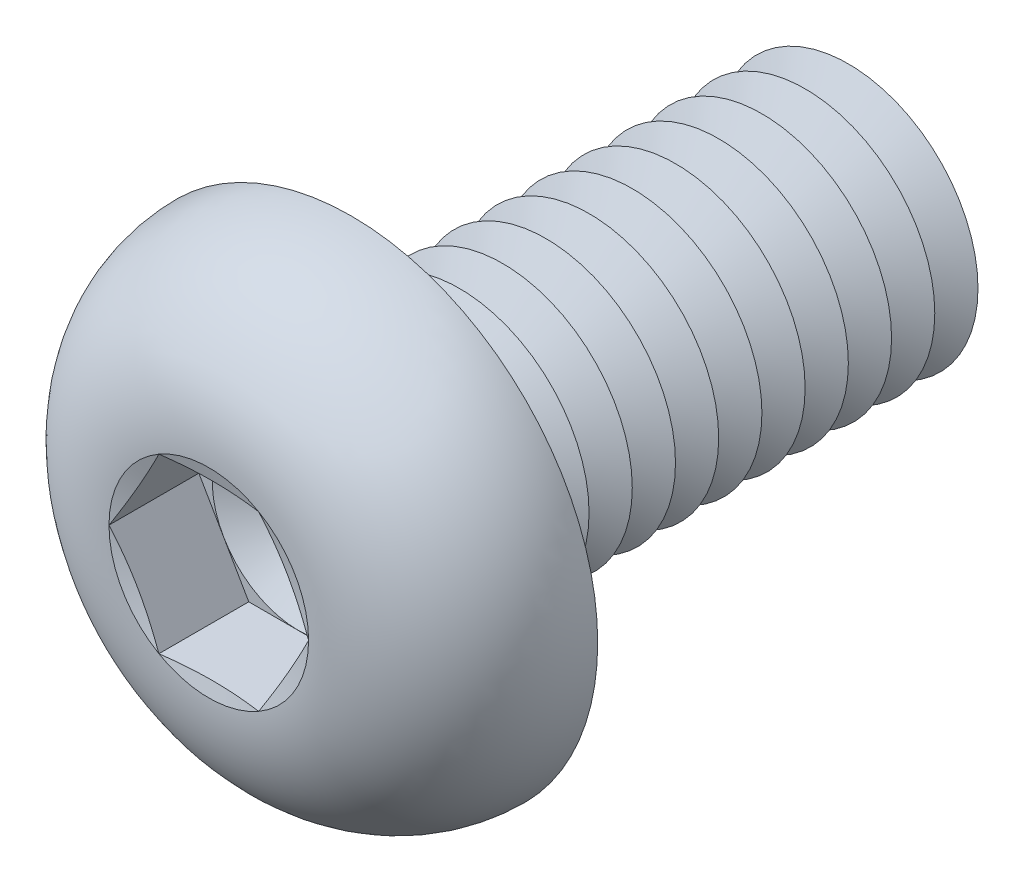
ISO-10303-21;
HEADER;
FILE_DESCRIPTION(('STEP AP214'),'2;1');
FILE_NAME('part.step','',(''),(''),'','','');
FILE_SCHEMA(('AUTOMOTIVE_DESIGN { 1 0 10303 214 1 1 1 1 }'));
ENDSEC;
DATA;
#1=APPLICATION_CONTEXT('core data for automotive mechanical design processes');
#2=APPLICATION_PROTOCOL_DEFINITION('international standard','automotive_design',2000,#1);
#3=PRODUCT_CONTEXT('',#1,'mechanical');
#4=PRODUCT('Part','Part','',(#3));
#5=PRODUCT_RELATED_PRODUCT_CATEGORY('part','',(#4));
#6=PRODUCT_DEFINITION_FORMATION('','',#4);
#7=PRODUCT_DEFINITION_CONTEXT('part definition',#1,'design');
#8=PRODUCT_DEFINITION('design','',#6,#7);
#9=PRODUCT_DEFINITION_SHAPE('','',#8);
#10=(LENGTH_UNIT() NAMED_UNIT(*) SI_UNIT(.MILLI.,.METRE.));
#11=(NAMED_UNIT(*) PLANE_ANGLE_UNIT() SI_UNIT($,.RADIAN.));
#12=(NAMED_UNIT(*) SI_UNIT($,.STERADIAN.) SOLID_ANGLE_UNIT());
#13=UNCERTAINTY_MEASURE_WITH_UNIT(LENGTH_MEASURE(1.E-05),#10,'distance_accuracy_value','');
#14=(GEOMETRIC_REPRESENTATION_CONTEXT(3) GLOBAL_UNCERTAINTY_ASSIGNED_CONTEXT((#13)) GLOBAL_UNIT_ASSIGNED_CONTEXT((#10,
#11,#12)) REPRESENTATION_CONTEXT('',''));
#15=CARTESIAN_POINT('',(0.,0.,0.));
#16=DIRECTION('',(0.,0.,1.));
#17=DIRECTION('',(1.,0.,0.));
#18=AXIS2_PLACEMENT_3D('',#15,#16,#17);
#19=CARTESIAN_POINT('',(0.,0.,0.609999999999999));
#20=DIRECTION('',(0.,0.,1.));
#21=DIRECTION('',(1.,0.,0.));
#22=AXIS2_PLACEMENT_3D('',#19,#20,#21);
#23=PLANE('',#22);
#24=CARTESIAN_POINT('',(0.,0.,0.609999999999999));
#25=DIRECTION('',(0.,0.,1.));
#26=DIRECTION('',(1.,0.,0.));
#27=AXIS2_PLACEMENT_3D('',#24,#25,#26);
#28=CIRCLE('',#27,0.999999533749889);
#29=CARTESIAN_POINT('',(0.866024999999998,0.499999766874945,0.609999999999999));
#30=VERTEX_POINT('',#29);
#31=CARTESIAN_POINT('',(0.,0.999999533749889,0.609999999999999));
#32=VERTEX_POINT('',#31);
#33=EDGE_CURVE('E118',#30,#32,#28,.T.);
#34=ORIENTED_EDGE('',*,*,#33,.F.);
#35=DIRECTION('',(-0.500000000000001,0.866025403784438,0.));
#36=VECTOR('',#35,1.);
#37=CARTESIAN_POINT('',(1.1547,0.,0.609999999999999));
#38=LINE('',#37,#36);
#39=CARTESIAN_POINT('',(0.577349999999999,0.999999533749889,0.609999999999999));
#40=VERTEX_POINT('',#39);
#41=EDGE_CURVE('E125',#30,#40,#38,.T.);
#42=ORIENTED_EDGE('',*,*,#41,.T.);
#43=DIRECTION('',(-1.,0.,0.));
#44=VECTOR('',#43,1.);
#45=CARTESIAN_POINT('',(0.577349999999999,0.999999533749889,0.609999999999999));
#46=LINE('',#45,#44);
#47=EDGE_CURVE('E136',#40,#32,#46,.T.);
#48=ORIENTED_EDGE('',*,*,#47,.T.);
#49=EDGE_LOOP('',(#34,#42,#48));
#50=FACE_BOUND('',#49,.T.);
#51=ADVANCED_FACE('F39',(#50),#23,.T.);
#52=CARTESIAN_POINT('',(0.,0.,0.609999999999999));
#53=DIRECTION('',(0.,0.,1.));
#54=DIRECTION('',(1.,0.,0.));
#55=AXIS2_PLACEMENT_3D('',#52,#53,#54);
#56=CIRCLE('',#55,0.999999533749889);
#57=CARTESIAN_POINT('',(-0.866024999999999,0.499999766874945,0.609999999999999));
#58=VERTEX_POINT('',#57);
#59=EDGE_CURVE('E11',#32,#58,#56,.T.);
#60=ORIENTED_EDGE('',*,*,#59,.F.);
#61=CARTESIAN_POINT('',(-0.577350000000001,0.999999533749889,0.609999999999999));
#62=VERTEX_POINT('',#61);
#63=EDGE_CURVE('E131',#32,#62,#46,.T.);
#64=ORIENTED_EDGE('',*,*,#63,.T.);
#65=DIRECTION('',(-0.5,-0.866025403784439,0.));
#66=VECTOR('',#65,1.);
#67=CARTESIAN_POINT('',(-0.577350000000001,0.999999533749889,0.609999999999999));
#68=LINE('',#67,#66);
#69=EDGE_CURVE('E134',#62,#58,#68,.T.);
#70=ORIENTED_EDGE('',*,*,#69,.T.);
#71=EDGE_LOOP('',(#60,#64,#70));
#72=FACE_BOUND('',#71,.T.);
#73=ADVANCED_FACE('F130',(#72),#23,.T.);
#74=CARTESIAN_POINT('',(-0.866024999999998,-0.499999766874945,0.609999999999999));
#75=VERTEX_POINT('',#74);
#76=EDGE_CURVE('E49',#58,#75,#56,.T.);
#77=ORIENTED_EDGE('',*,*,#76,.F.);
#78=CARTESIAN_POINT('',(-1.1547,0.,0.609999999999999));
#79=VERTEX_POINT('',#78);
#80=EDGE_CURVE('E143',#58,#79,#68,.T.);
#81=ORIENTED_EDGE('',*,*,#80,.T.);
#82=DIRECTION('',(0.5,-0.866025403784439,0.));
#83=VECTOR('',#82,1.);
#84=CARTESIAN_POINT('',(-1.1547,0.,0.609999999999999));
#85=LINE('',#84,#83);
#86=EDGE_CURVE('E151',#79,#75,#85,.T.);
#87=ORIENTED_EDGE('',*,*,#86,.T.);
#88=EDGE_LOOP('',(#77,#81,#87));
#89=FACE_BOUND('',#88,.T.);
#90=ADVANCED_FACE('F363',(#89),#23,.T.);
#91=CARTESIAN_POINT('',(0.,-0.999999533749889,0.609999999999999));
#92=VERTEX_POINT('',#91);
#93=EDGE_CURVE('E347',#75,#92,#56,.T.);
#94=ORIENTED_EDGE('',*,*,#93,.F.);
#95=CARTESIAN_POINT('',(-0.577349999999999,-0.99999953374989,0.609999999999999));
#96=VERTEX_POINT('',#95);
#97=EDGE_CURVE('E150',#75,#96,#85,.T.);
#98=ORIENTED_EDGE('',*,*,#97,.T.);
#99=DIRECTION('',(1.,0.,0.));
#100=VECTOR('',#99,1.);
#101=CARTESIAN_POINT('',(-0.577349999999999,-0.99999953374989,0.609999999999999));
#102=LINE('',#101,#100);
#103=EDGE_CURVE('E156',#96,#92,#102,.T.);
#104=ORIENTED_EDGE('',*,*,#103,.T.);
#105=EDGE_LOOP('',(#94,#98,#104));
#106=FACE_BOUND('',#105,.T.);
#107=ADVANCED_FACE('F356',(#106),#23,.T.);
#108=CARTESIAN_POINT('',(0.866024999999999,-0.499999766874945,0.609999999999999));
#109=VERTEX_POINT('',#108);
#110=EDGE_CURVE('E56',#92,#109,#56,.T.);
#111=ORIENTED_EDGE('',*,*,#110,.F.);
#112=CARTESIAN_POINT('',(0.577349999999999,-0.99999953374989,0.609999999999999));
#113=VERTEX_POINT('',#112);
#114=EDGE_CURVE('E155',#92,#113,#102,.T.);
#115=ORIENTED_EDGE('',*,*,#114,.T.);
#116=DIRECTION('',(0.5,0.866025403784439,0.));
#117=VECTOR('',#116,1.);
#118=CARTESIAN_POINT('',(0.577349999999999,-0.99999953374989,0.609999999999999));
#119=LINE('',#118,#117);
#120=EDGE_CURVE('E161',#113,#109,#119,.T.);
#121=ORIENTED_EDGE('',*,*,#120,.T.);
#122=EDGE_LOOP('',(#111,#115,#121));
#123=FACE_BOUND('',#122,.T.);
#124=ADVANCED_FACE('F429',(#123),#23,.T.);
#125=CARTESIAN_POINT('',(0.,0.,1.65));
#126=DIRECTION('',(0.,0.,1.));
#127=DIRECTION('',(1.,0.,0.));
#128=AXIS2_PLACEMENT_3D('',#125,#126,#127);
#129=CONICAL_SURFACE('',#128,1.1547,1.30899693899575);
#130=CARTESIAN_POINT('',(1.15481547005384,-0.000199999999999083,1.65003094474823));
#131=CARTESIAN_POINT('',(1.13083002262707,0.0413440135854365,1.64359970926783));
#132=CARTESIAN_POINT('',(1.10680107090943,0.0829633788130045,1.63776108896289));
#133=CARTESIAN_POINT('',(1.05865826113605,0.166349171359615,1.62750303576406));
#134=CARTESIAN_POINT('',(1.03454437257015,0.208115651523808,1.62308418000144));
#135=CARTESIAN_POINT('',(0.986377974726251,0.291542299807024,1.61592375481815));
#136=CARTESIAN_POINT('',(0.962325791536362,0.333201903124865,1.61317364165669));
#137=CARTESIAN_POINT('',(0.914190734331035,0.416574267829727,1.60948600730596));
#138=CARTESIAN_POINT('',(0.890107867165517,0.458287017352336,1.60854813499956));
#139=CARTESIAN_POINT('',(0.841942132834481,0.541712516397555,1.60854813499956));
#140=CARTESIAN_POINT('',(0.817859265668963,0.583425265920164,1.60948600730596));
#141=CARTESIAN_POINT('',(0.769724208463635,0.666797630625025,1.61317364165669));
#142=CARTESIAN_POINT('',(0.745672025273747,0.708457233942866,1.61592375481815));
#143=CARTESIAN_POINT('',(0.697505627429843,0.791883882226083,1.62308418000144));
#144=CARTESIAN_POINT('',(0.673391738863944,0.833650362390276,1.62750303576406));
#145=CARTESIAN_POINT('',(0.625248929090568,0.917036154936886,1.63776108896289));
#146=CARTESIAN_POINT('',(0.60121997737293,0.958655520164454,1.64359970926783));
#147=CARTESIAN_POINT('',(0.577234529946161,1.00019953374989,1.65003094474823));
#148=B_SPLINE_CURVE_WITH_KNOTS('',3,(#130,#131,#132,#133,#134,#135,#136,#137,#138,#139,#140,
#141,#142,#143,#144,#145,#146,#147),.UNSPECIFIED.,.F.,.F.,(4,2,2,2,2,2,2,2,4),(0.,
0.145207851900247,0.290474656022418,0.434991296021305,0.579479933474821,0.723968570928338,
0.868485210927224,1.0137520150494,1.15895986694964),.UNSPECIFIED.);
#149=CARTESIAN_POINT('',(1.1547,0.,1.65));
#150=VERTEX_POINT('',#149);
#151=CARTESIAN_POINT('',(0.57735,0.99999953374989,1.65));
#152=VERTEX_POINT('',#151);
#153=EDGE_CURVE('E220',#150,#152,#148,.T.);
#154=ORIENTED_EDGE('',*,*,#153,.F.);
#155=CARTESIAN_POINT('',(0.,0.,1.65));
#156=DIRECTION('',(0.,0.,-1.));
#157=DIRECTION('',(-1.,0.,0.));
#158=AXIS2_PLACEMENT_3D('',#155,#156,#157);
#159=CIRCLE('',#158,1.1547);
#160=EDGE_CURVE('E394',#152,#150,#159,.T.);
#161=ORIENTED_EDGE('',*,*,#160,.F.);
#162=EDGE_LOOP('',(#154,#161));
#163=FACE_BOUND('',#162,.T.);
#164=ADVANCED_FACE('F433',(#163),#129,.F.);
#165=CARTESIAN_POINT('',(0.577234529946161,-1.00019953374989,1.65003094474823));
#166=CARTESIAN_POINT('',(0.60121997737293,-0.958655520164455,1.64359970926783));
#167=CARTESIAN_POINT('',(0.625248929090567,-0.917036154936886,1.63776108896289));
#168=CARTESIAN_POINT('',(0.673391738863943,-0.833650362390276,1.62750303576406));
#169=CARTESIAN_POINT('',(0.697505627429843,-0.791883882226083,1.62308418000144));
#170=CARTESIAN_POINT('',(0.745672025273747,-0.708457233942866,1.61592375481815));
#171=CARTESIAN_POINT('',(0.769724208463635,-0.666797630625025,1.61317364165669));
#172=CARTESIAN_POINT('',(0.817859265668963,-0.583425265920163,1.60948600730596));
#173=CARTESIAN_POINT('',(0.841942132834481,-0.541712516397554,1.60854813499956));
#174=CARTESIAN_POINT('',(0.890107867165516,-0.458287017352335,1.60854813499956));
#175=CARTESIAN_POINT('',(0.914190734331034,-0.416574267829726,1.60948600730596));
#176=CARTESIAN_POINT('',(0.962325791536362,-0.333201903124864,1.61317364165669));
#177=CARTESIAN_POINT('',(0.986377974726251,-0.291542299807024,1.61592375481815));
#178=CARTESIAN_POINT('',(1.03454437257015,-0.208115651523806,1.62308418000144));
#179=CARTESIAN_POINT('',(1.05865826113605,-0.166349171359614,1.62750303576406));
#180=CARTESIAN_POINT('',(1.10680107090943,-0.0829633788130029,1.63776108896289));
#181=CARTESIAN_POINT('',(1.13083002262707,-0.0413440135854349,1.64359970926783));
#182=CARTESIAN_POINT('',(1.15481547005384,0.00020000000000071,1.65003094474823));
#183=B_SPLINE_CURVE_WITH_KNOTS('',3,(#165,#166,#167,#168,#169,#170,#171,#172,#173,#174,#175,
#176,#177,#178,#179,#180,#181,#182),.UNSPECIFIED.,.F.,.F.,(4,2,2,2,2,2,2,2,4),(0.,
0.145207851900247,0.290474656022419,0.434991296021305,0.579479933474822,0.723968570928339,
0.868485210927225,1.0137520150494,1.15895986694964),.UNSPECIFIED.);
#184=CARTESIAN_POINT('',(0.577349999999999,-0.99999953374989,1.65));
#185=VERTEX_POINT('',#184);
#186=EDGE_CURVE('E229',#185,#150,#183,.T.);
#187=ORIENTED_EDGE('',*,*,#186,.F.);
#188=EDGE_CURVE('E396',#150,#185,#159,.T.);
#189=ORIENTED_EDGE('',*,*,#188,.F.);
#190=EDGE_LOOP('',(#187,#189));
#191=FACE_BOUND('',#190,.T.);
#192=ADVANCED_FACE('F439',(#191),#129,.F.);
#193=CARTESIAN_POINT('',(-1.7425668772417,-0.99999953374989,1.87893949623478));
#194=CARTESIAN_POINT('',(-1.65819693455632,-0.99999953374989,1.85935934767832));
#195=CARTESIAN_POINT('',(-1.57375647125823,-0.99999953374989,1.84006351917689));
#196=CARTESIAN_POINT('',(-1.40464514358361,-0.99999953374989,1.80242908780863));
#197=CARTESIAN_POINT('',(-1.31997423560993,-0.99999953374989,1.78409068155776));
#198=CARTESIAN_POINT('',(-1.14955192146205,-0.99999953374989,1.74860242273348));
#199=CARTESIAN_POINT('',(-1.06379782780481,-0.99999953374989,1.73146532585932));
#200=CARTESIAN_POINT('',(-0.891887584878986,-0.99999953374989,1.69925819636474));
#201=CARTESIAN_POINT('',(-0.805731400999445,-0.99999953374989,1.68418834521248));
#202=CARTESIAN_POINT('',(-0.635256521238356,-0.99999953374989,1.65751615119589));
#203=CARTESIAN_POINT('',(-0.550951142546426,-0.99999953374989,1.64583105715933));
#204=CARTESIAN_POINT('',(-0.381865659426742,-0.99999953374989,1.62668811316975));
#205=CARTESIAN_POINT('',(-0.297085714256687,-0.99999953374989,1.61922892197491));
#206=CARTESIAN_POINT('',(-0.127577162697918,-0.99999953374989,1.60981453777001));
#207=CARTESIAN_POINT('',(-0.0428499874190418,-0.99999953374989,1.60783514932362));
#208=CARTESIAN_POINT('',(0.126542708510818,-0.99999953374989,1.60973012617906));
#209=CARTESIAN_POINT('',(0.211208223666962,-0.99999953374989,1.61360496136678));
#210=CARTESIAN_POINT('',(0.356115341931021,-0.99999953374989,1.62460226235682));
#211=CARTESIAN_POINT('',(0.416458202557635,-0.99999953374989,1.63048841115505));
#212=CARTESIAN_POINT('',(0.536893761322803,-0.99999953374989,1.64437752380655));
#213=CARTESIAN_POINT('',(0.596986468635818,-0.99999953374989,1.65238040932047));
#214=CARTESIAN_POINT('',(0.777275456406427,-0.99999953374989,1.67888855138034));
#215=CARTESIAN_POINT('',(0.897104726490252,-0.99999953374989,1.69985858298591));
#216=CARTESIAN_POINT('',(1.07751611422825,-0.99999953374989,1.73433574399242));
#217=CARTESIAN_POINT('',(1.1383777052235,-0.99999953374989,1.74646914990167));
#218=CARTESIAN_POINT('',(1.25994955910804,-0.99999953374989,1.7714845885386));
#219=CARTESIAN_POINT('',(1.32065982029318,-0.99999953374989,1.7843666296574));
#220=CARTESIAN_POINT('',(1.44162663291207,-0.99999953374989,1.81062164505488));
#221=CARTESIAN_POINT('',(1.50188385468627,-0.99999953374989,1.82399156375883));
#222=CARTESIAN_POINT('',(1.62229550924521,-0.99999953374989,1.85116781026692));
#223=CARTESIAN_POINT('',(1.68244994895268,-0.99999953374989,1.86497410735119));
#224=CARTESIAN_POINT('',(1.7425668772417,-0.99999953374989,1.87893949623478));
#225=B_SPLINE_CURVE_WITH_KNOTS('',3,(#193,#194,#195,#196,#197,#198,#199,#200,#201,#202,#203,
#204,#205,#206,#207,#208,#209,#210,#211,#212,#213,#214,#215,#216,#217,#218,#219,#220,#221,#222,
#223,#224),.UNSPECIFIED.,.F.,.F.,(4,2,2,2,2,2,2,2,2,2,2,2,2,2,2,4),(0.,0.259842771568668,
0.519738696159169,0.782071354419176,1.04442702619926,1.29968778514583,1.55486748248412,
1.80891865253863,2.06299021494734,2.24483732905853,2.42667771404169,2.79149503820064,
2.97767344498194,3.16385393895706,3.34902052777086,3.53417411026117),.UNSPECIFIED.);
#226=CARTESIAN_POINT('',(-0.577349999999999,-0.99999953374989,1.65));
#227=VERTEX_POINT('',#226);
#228=EDGE_CURVE('E375',#227,#185,#225,.T.);
#229=ORIENTED_EDGE('',*,*,#228,.F.);
#230=EDGE_CURVE('E383',#185,#227,#159,.T.);
#231=ORIENTED_EDGE('',*,*,#230,.F.);
#232=EDGE_LOOP('',(#229,#231));
#233=FACE_BOUND('',#232,.T.);
#234=ADVANCED_FACE('F455',(#233),#129,.F.);
#235=CARTESIAN_POINT('',(-1.15481547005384,0.000200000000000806,1.65003094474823));
#236=CARTESIAN_POINT('',(-1.13083002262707,-0.0413440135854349,1.64359970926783));
#237=CARTESIAN_POINT('',(-1.10680107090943,-0.082963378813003,1.63776108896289));
#238=CARTESIAN_POINT('',(-1.05865826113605,-0.166349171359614,1.62750303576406));
#239=CARTESIAN_POINT('',(-1.03454437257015,-0.208115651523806,1.62308418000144));
#240=CARTESIAN_POINT('',(-0.986377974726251,-0.291542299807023,1.61592375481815));
#241=CARTESIAN_POINT('',(-0.962325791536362,-0.333201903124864,1.61317364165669));
#242=CARTESIAN_POINT('',(-0.914190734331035,-0.416574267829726,1.60948600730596));
#243=CARTESIAN_POINT('',(-0.890107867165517,-0.458287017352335,1.60854813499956));
#244=CARTESIAN_POINT('',(-0.841942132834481,-0.541712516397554,1.60854813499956));
#245=CARTESIAN_POINT('',(-0.817859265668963,-0.583425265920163,1.60948600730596));
#246=CARTESIAN_POINT('',(-0.769724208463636,-0.666797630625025,1.61317364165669));
#247=CARTESIAN_POINT('',(-0.745672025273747,-0.708457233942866,1.61592375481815));
#248=CARTESIAN_POINT('',(-0.697505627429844,-0.791883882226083,1.62308418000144));
#249=CARTESIAN_POINT('',(-0.673391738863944,-0.833650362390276,1.62750303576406));
#250=CARTESIAN_POINT('',(-0.625248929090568,-0.917036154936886,1.63776108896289));
#251=CARTESIAN_POINT('',(-0.60121997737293,-0.958655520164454,1.64359970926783));
#252=CARTESIAN_POINT('',(-0.577234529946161,-1.00019953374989,1.65003094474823));
#253=B_SPLINE_CURVE_WITH_KNOTS('',3,(#235,#236,#237,#238,#239,#240,#241,#242,#243,#244,#245,
#246,#247,#248,#249,#250,#251,#252),.UNSPECIFIED.,.F.,.F.,(4,2,2,2,2,2,2,2,4),(0.,
0.145207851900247,0.290474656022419,0.434991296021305,0.579479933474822,0.723968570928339,
0.868485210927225,1.0137520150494,1.15895986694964),.UNSPECIFIED.);
#254=CARTESIAN_POINT('',(-1.1547,0.,1.65));
#255=VERTEX_POINT('',#254);
#256=EDGE_CURVE('E368',#255,#227,#253,.T.);
#257=ORIENTED_EDGE('',*,*,#256,.F.);
#258=EDGE_CURVE('E331',#227,#255,#159,.T.);
#259=ORIENTED_EDGE('',*,*,#258,.F.);
#260=EDGE_LOOP('',(#257,#259));
#261=FACE_BOUND('',#260,.T.);
#262=ADVANCED_FACE('F372',(#261),#129,.F.);
#263=CARTESIAN_POINT('',(-0.577234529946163,1.00019953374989,1.65003094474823));
#264=CARTESIAN_POINT('',(-0.601219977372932,0.958655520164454,1.64359970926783));
#265=CARTESIAN_POINT('',(-0.625248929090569,0.917036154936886,1.63776108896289));
#266=CARTESIAN_POINT('',(-0.673391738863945,0.833650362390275,1.62750303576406));
#267=CARTESIAN_POINT('',(-0.697505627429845,0.791883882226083,1.62308418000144));
#268=CARTESIAN_POINT('',(-0.745672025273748,0.708457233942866,1.61592375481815));
#269=CARTESIAN_POINT('',(-0.769724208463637,0.666797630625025,1.61317364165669));
#270=CARTESIAN_POINT('',(-0.817859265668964,0.583425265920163,1.60948600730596));
#271=CARTESIAN_POINT('',(-0.841942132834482,0.541712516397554,1.60854813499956));
#272=CARTESIAN_POINT('',(-0.890107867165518,0.458287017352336,1.60854813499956));
#273=CARTESIAN_POINT('',(-0.914190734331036,0.416574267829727,1.60948600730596));
#274=CARTESIAN_POINT('',(-0.962325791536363,0.333201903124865,1.61317364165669));
#275=CARTESIAN_POINT('',(-0.986377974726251,0.291542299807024,1.61592375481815));
#276=CARTESIAN_POINT('',(-1.03454437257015,0.208115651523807,1.62308418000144));
#277=CARTESIAN_POINT('',(-1.05865826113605,0.166349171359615,1.62750303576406));
#278=CARTESIAN_POINT('',(-1.10680107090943,0.0829633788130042,1.63776108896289));
#279=CARTESIAN_POINT('',(-1.13083002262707,0.0413440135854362,1.64359970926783));
#280=CARTESIAN_POINT('',(-1.15481547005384,-0.000199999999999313,1.65003094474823));
#281=B_SPLINE_CURVE_WITH_KNOTS('',3,(#263,#264,#265,#266,#267,#268,#269,#270,#271,#272,#273,
#274,#275,#276,#277,#278,#279,#280),.UNSPECIFIED.,.F.,.F.,(4,2,2,2,2,2,2,2,4),(0.,
0.145207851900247,0.290474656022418,0.434991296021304,0.579479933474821,0.723968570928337,
0.868485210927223,1.01375201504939,1.15895986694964),.UNSPECIFIED.);
#282=CARTESIAN_POINT('',(-0.577350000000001,0.999999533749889,1.65));
#283=VERTEX_POINT('',#282);
#284=EDGE_CURVE('E194',#283,#255,#281,.T.);
#285=ORIENTED_EDGE('',*,*,#284,.F.);
#286=EDGE_CURVE('E332',#255,#283,#159,.T.);
#287=ORIENTED_EDGE('',*,*,#286,.F.);
#288=EDGE_LOOP('',(#285,#287));
#289=FACE_BOUND('',#288,.T.);
#290=ADVANCED_FACE('F386',(#289),#129,.F.);
#291=CARTESIAN_POINT('',(0.,0.,-4.25));
#292=DIRECTION('',(0.,0.,1.));
#293=DIRECTION('',(1.,0.,0.));
#294=AXIS2_PLACEMENT_3D('',#291,#292,#293);
#295=CONICAL_SURFACE('',#294,1.5,1.0471975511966);
#296=CARTESIAN_POINT('',(0.,0.,-4.5));
#297=DIRECTION('',(0.,0.,1.));
#298=DIRECTION('',(1.,0.,0.));
#299=AXIS2_PLACEMENT_3D('',#296,#297,#298);
#300=CIRCLE('',#299,1.06698729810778);
#301=CARTESIAN_POINT('',(1.06698729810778,0.,-4.5));
#302=VERTEX_POINT('',#301);
#303=EDGE_CURVE('E303',#302,#302,#300,.T.);
#304=ORIENTED_EDGE('',*,*,#303,.T.);
#305=EDGE_LOOP('',(#304));
#306=FACE_BOUND('',#305,.T.);
#307=CARTESIAN_POINT('',(0.,0.,-4.25));
#308=DIRECTION('',(0.,0.,1.));
#309=DIRECTION('',(1.,0.,0.));
#310=AXIS2_PLACEMENT_3D('',#307,#308,#309);
#311=CIRCLE('',#310,1.5);
#312=CARTESIAN_POINT('',(1.5,0.,-4.25));
#313=VERTEX_POINT('',#312);
#314=EDGE_CURVE('E299',#313,#313,#311,.T.);
#315=ORIENTED_EDGE('',*,*,#314,.F.);
#316=EDGE_LOOP('',(#315));
#317=FACE_BOUND('',#316,.T.);
#318=ADVANCED_FACE('F521',(#306,#317),#295,.T.);
#319=CARTESIAN_POINT('',(0.,0.,-4.5));
#320=DIRECTION('',(0.,0.,-1.));
#321=DIRECTION('',(-1.,0.,0.));
#322=AXIS2_PLACEMENT_3D('',#319,#320,#321);
#323=CONICAL_SURFACE('',#322,1.06698729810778,1.0471975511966);
#324=CARTESIAN_POINT('',(0.,0.,-4.75));
#325=DIRECTION('',(0.,0.,1.));
#326=DIRECTION('',(1.,0.,0.));
#327=AXIS2_PLACEMENT_3D('',#324,#325,#326);
#328=CIRCLE('',#327,1.5);
#329=CARTESIAN_POINT('',(1.5,0.,-4.75));
#330=VERTEX_POINT('',#329);
#331=EDGE_CURVE('E307',#330,#330,#328,.T.);
#332=ORIENTED_EDGE('',*,*,#331,.T.);
#333=EDGE_LOOP('',(#332));
#334=FACE_BOUND('',#333,.T.);
#335=ORIENTED_EDGE('',*,*,#303,.F.);
#336=EDGE_LOOP('',(#335));
#337=FACE_BOUND('',#336,.T.);
#338=ADVANCED_FACE('F760',(#334,#337),#323,.T.);
#339=CARTESIAN_POINT('',(0.,1.5,-6.));
#340=DIRECTION('',(0.,0.,-1.));
#341=DIRECTION('',(-1.,0.,0.));
#342=AXIS2_PLACEMENT_3D('',#339,#340,#341);
#343=PLANE('',#342);
#344=CARTESIAN_POINT('',(0.,0.,-6.));
#345=DIRECTION('',(0.,0.,1.));
#346=DIRECTION('',(1.,0.,0.));
#347=AXIS2_PLACEMENT_3D('',#344,#345,#346);
#348=CIRCLE('',#347,1.06698729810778);
#349=CARTESIAN_POINT('',(1.06698729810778,0.,-6.));
#350=VERTEX_POINT('',#349);
#351=EDGE_CURVE('E327',#350,#350,#348,.T.);
#352=ORIENTED_EDGE('',*,*,#351,.F.);
#353=EDGE_LOOP('',(#352));
#354=FACE_BOUND('',#353,.T.);
#355=ADVANCED_FACE('F754',(#354),#343,.T.);
#356=CARTESIAN_POINT('',(0.,0.,-5.75));
#357=DIRECTION('',(0.,0.,1.));
#358=DIRECTION('',(1.,0.,0.));
#359=AXIS2_PLACEMENT_3D('',#356,#357,#358);
#360=CONICAL_SURFACE('',#359,1.5,1.0471975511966);
#361=ORIENTED_EDGE('',*,*,#351,.T.);
#362=EDGE_LOOP('',(#361));
#363=FACE_BOUND('',#362,.T.);
#364=CARTESIAN_POINT('',(0.,0.,-5.75));
#365=DIRECTION('',(0.,0.,1.));
#366=DIRECTION('',(1.,0.,0.));
#367=AXIS2_PLACEMENT_3D('',#364,#365,#366);
#368=CIRCLE('',#367,1.5);
#369=CARTESIAN_POINT('',(1.5,0.,-5.75));
#370=VERTEX_POINT('',#369);
#371=EDGE_CURVE('E323',#370,#370,#368,.T.);
#372=ORIENTED_EDGE('',*,*,#371,.F.);
#373=EDGE_LOOP('',(#372));
#374=FACE_BOUND('',#373,.T.);
#375=ADVANCED_FACE('F747',(#363,#374),#360,.T.);
#376=CARTESIAN_POINT('',(0.,0.,-5.5));
#377=DIRECTION('',(0.,0.,-1.));
#378=DIRECTION('',(-1.,0.,0.));
#379=AXIS2_PLACEMENT_3D('',#376,#377,#378);
#380=CONICAL_SURFACE('',#379,1.06698729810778,1.0471975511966);
#381=ORIENTED_EDGE('',*,*,#371,.T.);
#382=EDGE_LOOP('',(#381));
#383=FACE_BOUND('',#382,.T.);
#384=CARTESIAN_POINT('',(0.,0.,-5.5));
#385=DIRECTION('',(0.,0.,1.));
#386=DIRECTION('',(1.,0.,0.));
#387=AXIS2_PLACEMENT_3D('',#384,#385,#386);
#388=CIRCLE('',#387,1.06698729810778);
#389=CARTESIAN_POINT('',(1.06698729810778,0.,-5.5));
#390=VERTEX_POINT('',#389);
#391=EDGE_CURVE('E319',#390,#390,#388,.T.);
#392=ORIENTED_EDGE('',*,*,#391,.F.);
#393=EDGE_LOOP('',(#392));
#394=FACE_BOUND('',#393,.T.);
#395=ADVANCED_FACE('F740',(#383,#394),#380,.T.);
#396=CARTESIAN_POINT('',(0.,0.,-5.25));
#397=DIRECTION('',(0.,0.,1.));
#398=DIRECTION('',(1.,0.,0.));
#399=AXIS2_PLACEMENT_3D('',#396,#397,#398);
#400=CONICAL_SURFACE('',#399,1.5,1.0471975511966);
#401=ORIENTED_EDGE('',*,*,#391,.T.);
#402=EDGE_LOOP('',(#401));
#403=FACE_BOUND('',#402,.T.);
#404=CARTESIAN_POINT('',(0.,0.,-5.25));
#405=DIRECTION('',(0.,0.,1.));
#406=DIRECTION('',(1.,0.,0.));
#407=AXIS2_PLACEMENT_3D('',#404,#405,#406);
#408=CIRCLE('',#407,1.5);
#409=CARTESIAN_POINT('',(1.5,0.,-5.25));
#410=VERTEX_POINT('',#409);
#411=EDGE_CURVE('E315',#410,#410,#408,.T.);
#412=ORIENTED_EDGE('',*,*,#411,.F.);
#413=EDGE_LOOP('',(#412));
#414=FACE_BOUND('',#413,.T.);
#415=ADVANCED_FACE('F733',(#403,#414),#400,.T.);
#416=CARTESIAN_POINT('',(0.,0.,-5.));
#417=DIRECTION('',(0.,0.,-1.));
#418=DIRECTION('',(-1.,0.,0.));
#419=AXIS2_PLACEMENT_3D('',#416,#417,#418);
#420=CONICAL_SURFACE('',#419,1.06698729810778,1.0471975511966);
#421=ORIENTED_EDGE('',*,*,#411,.T.);
#422=EDGE_LOOP('',(#421));
#423=FACE_BOUND('',#422,.T.);
#424=CARTESIAN_POINT('',(0.,0.,-5.));
#425=DIRECTION('',(0.,0.,1.));
#426=DIRECTION('',(1.,0.,0.));
#427=AXIS2_PLACEMENT_3D('',#424,#425,#426);
#428=CIRCLE('',#427,1.06698729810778);
#429=CARTESIAN_POINT('',(1.06698729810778,0.,-5.));
#430=VERTEX_POINT('',#429);
#431=EDGE_CURVE('E311',#430,#430,#428,.T.);
#432=ORIENTED_EDGE('',*,*,#431,.F.);
#433=EDGE_LOOP('',(#432));
#434=FACE_BOUND('',#433,.T.);
#435=ADVANCED_FACE('F726',(#423,#434),#420,.T.);
#436=CARTESIAN_POINT('',(0.,0.,-4.75));
#437=DIRECTION('',(0.,0.,1.));
#438=DIRECTION('',(1.,0.,0.));
#439=AXIS2_PLACEMENT_3D('',#436,#437,#438);
#440=CONICAL_SURFACE('',#439,1.5,1.0471975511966);
#441=ORIENTED_EDGE('',*,*,#431,.T.);
#442=EDGE_LOOP('',(#441));
#443=FACE_BOUND('',#442,.T.);
#444=ORIENTED_EDGE('',*,*,#331,.F.);
#445=EDGE_LOOP('',(#444));
#446=FACE_BOUND('',#445,.T.);
#447=ADVANCED_FACE('F719',(#443,#446),#440,.T.);
#448=CARTESIAN_POINT('',(0.,0.,-3.75));
#449=DIRECTION('',(0.,0.,1.));
#450=DIRECTION('',(1.,0.,0.));
#451=AXIS2_PLACEMENT_3D('',#448,#449,#450);
#452=CONICAL_SURFACE('',#451,1.5,1.0471975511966);
#453=CARTESIAN_POINT('',(0.,0.,-4.));
#454=DIRECTION('',(0.,0.,1.));
#455=DIRECTION('',(1.,0.,0.));
#456=AXIS2_PLACEMENT_3D('',#453,#454,#455);
#457=CIRCLE('',#456,1.06698729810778);
#458=CARTESIAN_POINT('',(1.06698729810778,0.,-4.));
#459=VERTEX_POINT('',#458);
#460=EDGE_CURVE('E295',#459,#459,#457,.T.);
#461=ORIENTED_EDGE('',*,*,#460,.T.);
#462=EDGE_LOOP('',(#461));
#463=FACE_BOUND('',#462,.T.);
#464=CARTESIAN_POINT('',(0.,0.,-3.75));
#465=DIRECTION('',(0.,0.,1.));
#466=DIRECTION('',(1.,0.,0.));
#467=AXIS2_PLACEMENT_3D('',#464,#465,#466);
#468=CIRCLE('',#467,1.5);
#469=CARTESIAN_POINT('',(1.5,0.,-3.75));
#470=VERTEX_POINT('',#469);
#471=EDGE_CURVE('E291',#470,#470,#468,.T.);
#472=ORIENTED_EDGE('',*,*,#471,.F.);
#473=EDGE_LOOP('',(#472));
#474=FACE_BOUND('',#473,.T.);
#475=ADVANCED_FACE('F712',(#463,#474),#452,.T.);
#476=CARTESIAN_POINT('',(0.,0.,-4.));
#477=DIRECTION('',(0.,0.,-1.));
#478=DIRECTION('',(-1.,0.,0.));
#479=AXIS2_PLACEMENT_3D('',#476,#477,#478);
#480=CONICAL_SURFACE('',#479,1.06698729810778,1.0471975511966);
#481=ORIENTED_EDGE('',*,*,#314,.T.);
#482=EDGE_LOOP('',(#481));
#483=FACE_BOUND('',#482,.T.);
#484=ORIENTED_EDGE('',*,*,#460,.F.);
#485=EDGE_LOOP('',(#484));
#486=FACE_BOUND('',#485,.T.);
#487=ADVANCED_FACE('F705',(#483,#486),#480,.T.);
#488=CARTESIAN_POINT('',(0.,0.,-3.25));
#489=DIRECTION('',(0.,0.,1.));
#490=DIRECTION('',(1.,0.,0.));
#491=AXIS2_PLACEMENT_3D('',#488,#489,#490);
#492=CONICAL_SURFACE('',#491,1.5,1.0471975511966);
#493=CARTESIAN_POINT('',(0.,0.,-3.5));
#494=DIRECTION('',(0.,0.,1.));
#495=DIRECTION('',(1.,0.,0.));
#496=AXIS2_PLACEMENT_3D('',#493,#494,#495);
#497=CIRCLE('',#496,1.06698729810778);
#498=CARTESIAN_POINT('',(1.06698729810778,0.,-3.5));
#499=VERTEX_POINT('',#498);
#500=EDGE_CURVE('E287',#499,#499,#497,.T.);
#501=ORIENTED_EDGE('',*,*,#500,.T.);
#502=EDGE_LOOP('',(#501));
#503=FACE_BOUND('',#502,.T.);
#504=CARTESIAN_POINT('',(0.,0.,-3.25));
#505=DIRECTION('',(0.,0.,1.));
#506=DIRECTION('',(1.,0.,0.));
#507=AXIS2_PLACEMENT_3D('',#504,#505,#506);
#508=CIRCLE('',#507,1.5);
#509=CARTESIAN_POINT('',(1.5,0.,-3.25));
#510=VERTEX_POINT('',#509);
#511=EDGE_CURVE('E283',#510,#510,#508,.T.);
#512=ORIENTED_EDGE('',*,*,#511,.F.);
#513=EDGE_LOOP('',(#512));
#514=FACE_BOUND('',#513,.T.);
#515=ADVANCED_FACE('F698',(#503,#514),#492,.T.);
#516=CARTESIAN_POINT('',(0.,0.,-3.5));
#517=DIRECTION('',(0.,0.,-1.));
#518=DIRECTION('',(-1.,0.,0.));
#519=AXIS2_PLACEMENT_3D('',#516,#517,#518);
#520=CONICAL_SURFACE('',#519,1.06698729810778,1.0471975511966);
#521=ORIENTED_EDGE('',*,*,#471,.T.);
#522=EDGE_LOOP('',(#521));
#523=FACE_BOUND('',#522,.T.);
#524=ORIENTED_EDGE('',*,*,#500,.F.);
#525=EDGE_LOOP('',(#524));
#526=FACE_BOUND('',#525,.T.);
#527=ADVANCED_FACE('F691',(#523,#526),#520,.T.);
#528=CARTESIAN_POINT('',(0.,0.,-2.75));
#529=DIRECTION('',(0.,0.,1.));
#530=DIRECTION('',(1.,0.,0.));
#531=AXIS2_PLACEMENT_3D('',#528,#529,#530);
#532=CONICAL_SURFACE('',#531,1.5,1.0471975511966);
#533=CARTESIAN_POINT('',(0.,0.,-3.));
#534=DIRECTION('',(0.,0.,1.));
#535=DIRECTION('',(1.,0.,0.));
#536=AXIS2_PLACEMENT_3D('',#533,#534,#535);
#537=CIRCLE('',#536,1.06698729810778);
#538=CARTESIAN_POINT('',(1.06698729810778,0.,-3.));
#539=VERTEX_POINT('',#538);
#540=EDGE_CURVE('E279',#539,#539,#537,.T.);
#541=ORIENTED_EDGE('',*,*,#540,.T.);
#542=EDGE_LOOP('',(#541));
#543=FACE_BOUND('',#542,.T.);
#544=CARTESIAN_POINT('',(0.,0.,-2.75));
#545=DIRECTION('',(0.,0.,1.));
#546=DIRECTION('',(1.,0.,0.));
#547=AXIS2_PLACEMENT_3D('',#544,#545,#546);
#548=CIRCLE('',#547,1.5);
#549=CARTESIAN_POINT('',(1.5,0.,-2.75));
#550=VERTEX_POINT('',#549);
#551=EDGE_CURVE('E275',#550,#550,#548,.T.);
#552=ORIENTED_EDGE('',*,*,#551,.F.);
#553=EDGE_LOOP('',(#552));
#554=FACE_BOUND('',#553,.T.);
#555=ADVANCED_FACE('F684',(#543,#554),#532,.T.);
#556=CARTESIAN_POINT('',(0.,0.,-3.));
#557=DIRECTION('',(0.,0.,-1.));
#558=DIRECTION('',(-1.,0.,0.));
#559=AXIS2_PLACEMENT_3D('',#556,#557,#558);
#560=CONICAL_SURFACE('',#559,1.06698729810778,1.0471975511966);
#561=ORIENTED_EDGE('',*,*,#511,.T.);
#562=EDGE_LOOP('',(#561));
#563=FACE_BOUND('',#562,.T.);
#564=ORIENTED_EDGE('',*,*,#540,.F.);
#565=EDGE_LOOP('',(#564));
#566=FACE_BOUND('',#565,.T.);
#567=ADVANCED_FACE('F677',(#563,#566),#560,.T.);
#568=CARTESIAN_POINT('',(0.,0.,-2.25));
#569=DIRECTION('',(0.,0.,1.));
#570=DIRECTION('',(1.,0.,0.));
#571=AXIS2_PLACEMENT_3D('',#568,#569,#570);
#572=CONICAL_SURFACE('',#571,1.5,1.0471975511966);
#573=CARTESIAN_POINT('',(0.,0.,-2.5));
#574=DIRECTION('',(0.,0.,1.));
#575=DIRECTION('',(1.,0.,0.));
#576=AXIS2_PLACEMENT_3D('',#573,#574,#575);
#577=CIRCLE('',#576,1.06698729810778);
#578=CARTESIAN_POINT('',(1.06698729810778,0.,-2.5));
#579=VERTEX_POINT('',#578);
#580=EDGE_CURVE('E271',#579,#579,#577,.T.);
#581=ORIENTED_EDGE('',*,*,#580,.T.);
#582=EDGE_LOOP('',(#581));
#583=FACE_BOUND('',#582,.T.);
#584=CARTESIAN_POINT('',(0.,0.,-2.25));
#585=DIRECTION('',(0.,0.,1.));
#586=DIRECTION('',(1.,0.,0.));
#587=AXIS2_PLACEMENT_3D('',#584,#585,#586);
#588=CIRCLE('',#587,1.5);
#589=CARTESIAN_POINT('',(1.5,0.,-2.25));
#590=VERTEX_POINT('',#589);
#591=EDGE_CURVE('E267',#590,#590,#588,.T.);
#592=ORIENTED_EDGE('',*,*,#591,.F.);
#593=EDGE_LOOP('',(#592));
#594=FACE_BOUND('',#593,.T.);
#595=ADVANCED_FACE('F670',(#583,#594),#572,.T.);
#596=CARTESIAN_POINT('',(0.,0.,-2.5));
#597=DIRECTION('',(0.,0.,-1.));
#598=DIRECTION('',(-1.,0.,0.));
#599=AXIS2_PLACEMENT_3D('',#596,#597,#598);
#600=CONICAL_SURFACE('',#599,1.06698729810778,1.0471975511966);
#601=ORIENTED_EDGE('',*,*,#551,.T.);
#602=EDGE_LOOP('',(#601));
#603=FACE_BOUND('',#602,.T.);
#604=ORIENTED_EDGE('',*,*,#580,.F.);
#605=EDGE_LOOP('',(#604));
#606=FACE_BOUND('',#605,.T.);
#607=ADVANCED_FACE('F663',(#603,#606),#600,.T.);
#608=CARTESIAN_POINT('',(0.,0.,-1.75));
#609=DIRECTION('',(0.,0.,1.));
#610=DIRECTION('',(1.,0.,0.));
#611=AXIS2_PLACEMENT_3D('',#608,#609,#610);
#612=CONICAL_SURFACE('',#611,1.5,1.0471975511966);
#613=CARTESIAN_POINT('',(0.,0.,-2.));
#614=DIRECTION('',(0.,0.,1.));
#615=DIRECTION('',(1.,0.,0.));
#616=AXIS2_PLACEMENT_3D('',#613,#614,#615);
#617=CIRCLE('',#616,1.06698729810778);
#618=CARTESIAN_POINT('',(1.06698729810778,0.,-2.));
#619=VERTEX_POINT('',#618);
#620=EDGE_CURVE('E263',#619,#619,#617,.T.);
#621=ORIENTED_EDGE('',*,*,#620,.T.);
#622=EDGE_LOOP('',(#621));
#623=FACE_BOUND('',#622,.T.);
#624=CARTESIAN_POINT('',(0.,0.,-1.75));
#625=DIRECTION('',(0.,0.,1.));
#626=DIRECTION('',(1.,0.,0.));
#627=AXIS2_PLACEMENT_3D('',#624,#625,#626);
#628=CIRCLE('',#627,1.5);
#629=CARTESIAN_POINT('',(1.5,0.,-1.75));
#630=VERTEX_POINT('',#629);
#631=EDGE_CURVE('E259',#630,#630,#628,.T.);
#632=ORIENTED_EDGE('',*,*,#631,.F.);
#633=EDGE_LOOP('',(#632));
#634=FACE_BOUND('',#633,.T.);
#635=ADVANCED_FACE('F656',(#623,#634),#612,.T.);
#636=CARTESIAN_POINT('',(0.,0.,-2.));
#637=DIRECTION('',(0.,0.,-1.));
#638=DIRECTION('',(-1.,0.,0.));
#639=AXIS2_PLACEMENT_3D('',#636,#637,#638);
#640=CONICAL_SURFACE('',#639,1.06698729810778,1.0471975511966);
#641=ORIENTED_EDGE('',*,*,#591,.T.);
#642=EDGE_LOOP('',(#641));
#643=FACE_BOUND('',#642,.T.);
#644=ORIENTED_EDGE('',*,*,#620,.F.);
#645=EDGE_LOOP('',(#644));
#646=FACE_BOUND('',#645,.T.);
#647=ADVANCED_FACE('F649',(#643,#646),#640,.T.);
#648=CARTESIAN_POINT('',(0.,0.,-1.25));
#649=DIRECTION('',(0.,0.,1.));
#650=DIRECTION('',(1.,0.,0.));
#651=AXIS2_PLACEMENT_3D('',#648,#649,#650);
#652=CONICAL_SURFACE('',#651,1.5,1.0471975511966);
#653=CARTESIAN_POINT('',(0.,0.,-1.5));
#654=DIRECTION('',(0.,0.,1.));
#655=DIRECTION('',(1.,0.,0.));
#656=AXIS2_PLACEMENT_3D('',#653,#654,#655);
#657=CIRCLE('',#656,1.06698729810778);
#658=CARTESIAN_POINT('',(1.06698729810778,0.,-1.5));
#659=VERTEX_POINT('',#658);
#660=EDGE_CURVE('E255',#659,#659,#657,.T.);
#661=ORIENTED_EDGE('',*,*,#660,.T.);
#662=EDGE_LOOP('',(#661));
#663=FACE_BOUND('',#662,.T.);
#664=CARTESIAN_POINT('',(0.,0.,-1.25));
#665=DIRECTION('',(0.,0.,1.));
#666=DIRECTION('',(1.,0.,0.));
#667=AXIS2_PLACEMENT_3D('',#664,#665,#666);
#668=CIRCLE('',#667,1.5);
#669=CARTESIAN_POINT('',(1.5,0.,-1.25));
#670=VERTEX_POINT('',#669);
#671=EDGE_CURVE('E251',#670,#670,#668,.T.);
#672=ORIENTED_EDGE('',*,*,#671,.F.);
#673=EDGE_LOOP('',(#672));
#674=FACE_BOUND('',#673,.T.);
#675=ADVANCED_FACE('F642',(#663,#674),#652,.T.);
#676=CARTESIAN_POINT('',(0.,0.,-1.5));
#677=DIRECTION('',(0.,0.,-1.));
#678=DIRECTION('',(-1.,0.,0.));
#679=AXIS2_PLACEMENT_3D('',#676,#677,#678);
#680=CONICAL_SURFACE('',#679,1.06698729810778,1.0471975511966);
#681=ORIENTED_EDGE('',*,*,#631,.T.);
#682=EDGE_LOOP('',(#681));
#683=FACE_BOUND('',#682,.T.);
#684=ORIENTED_EDGE('',*,*,#660,.F.);
#685=EDGE_LOOP('',(#684));
#686=FACE_BOUND('',#685,.T.);
#687=ADVANCED_FACE('F635',(#683,#686),#680,.T.);
#688=CARTESIAN_POINT('',(0.,0.,-0.75));
#689=DIRECTION('',(0.,0.,1.));
#690=DIRECTION('',(1.,0.,0.));
#691=AXIS2_PLACEMENT_3D('',#688,#689,#690);
#692=CONICAL_SURFACE('',#691,1.5,1.0471975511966);
#693=CARTESIAN_POINT('',(0.,0.,-1.));
#694=DIRECTION('',(0.,0.,1.));
#695=DIRECTION('',(1.,0.,0.));
#696=AXIS2_PLACEMENT_3D('',#693,#694,#695);
#697=CIRCLE('',#696,1.06698729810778);
#698=CARTESIAN_POINT('',(1.06698729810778,0.,-1.));
#699=VERTEX_POINT('',#698);
#700=EDGE_CURVE('E247',#699,#699,#697,.T.);
#701=ORIENTED_EDGE('',*,*,#700,.T.);
#702=EDGE_LOOP('',(#701));
#703=FACE_BOUND('',#702,.T.);
#704=CARTESIAN_POINT('',(0.,0.,-0.750000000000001));
#705=DIRECTION('',(0.,0.,1.));
#706=DIRECTION('',(1.,0.,0.));
#707=AXIS2_PLACEMENT_3D('',#704,#705,#706);
#708=CIRCLE('',#707,1.5);
#709=CARTESIAN_POINT('',(1.5,0.,-0.750000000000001));
#710=VERTEX_POINT('',#709);
#711=EDGE_CURVE('E239',#710,#710,#708,.T.);
#712=ORIENTED_EDGE('',*,*,#711,.F.);
#713=EDGE_LOOP('',(#712));
#714=FACE_BOUND('',#713,.T.);
#715=ADVANCED_FACE('F628',(#703,#714),#692,.T.);
#716=CARTESIAN_POINT('',(0.,0.,-1.));
#717=DIRECTION('',(0.,0.,-1.));
#718=DIRECTION('',(-1.,0.,0.));
#719=AXIS2_PLACEMENT_3D('',#716,#717,#718);
#720=CONICAL_SURFACE('',#719,1.06698729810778,1.0471975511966);
#721=ORIENTED_EDGE('',*,*,#671,.T.);
#722=EDGE_LOOP('',(#721));
#723=FACE_BOUND('',#722,.T.);
#724=ORIENTED_EDGE('',*,*,#700,.F.);
#725=EDGE_LOOP('',(#724));
#726=FACE_BOUND('',#725,.T.);
#727=ADVANCED_FACE('F622',(#723,#726),#720,.T.);
#728=CARTESIAN_POINT('',(0.,0.,-0.25));
#729=DIRECTION('',(0.,0.,1.));
#730=DIRECTION('',(1.,0.,0.));
#731=AXIS2_PLACEMENT_3D('',#728,#729,#730);
#732=CONICAL_SURFACE('',#731,1.5,1.0471975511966);
#733=CARTESIAN_POINT('',(0.,0.,-0.5));
#734=DIRECTION('',(0.,0.,1.));
#735=DIRECTION('',(1.,0.,0.));
#736=AXIS2_PLACEMENT_3D('',#733,#734,#735);
#737=CIRCLE('',#736,1.06698729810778);
#738=CARTESIAN_POINT('',(1.06698729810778,0.,-0.5));
#739=VERTEX_POINT('',#738);
#740=EDGE_CURVE('E228',#739,#739,#737,.T.);
#741=ORIENTED_EDGE('',*,*,#740,.T.);
#742=EDGE_LOOP('',(#741));
#743=FACE_BOUND('',#742,.T.);
#744=CARTESIAN_POINT('',(0.,0.,-0.25));
#745=DIRECTION('',(0.,0.,1.));
#746=DIRECTION('',(1.,0.,0.));
#747=AXIS2_PLACEMENT_3D('',#744,#745,#746);
#748=CIRCLE('',#747,1.5);
#749=CARTESIAN_POINT('',(1.5,0.,-0.25));
#750=VERTEX_POINT('',#749);
#751=EDGE_CURVE('E243',#750,#750,#748,.T.);
#752=ORIENTED_EDGE('',*,*,#751,.F.);
#753=EDGE_LOOP('',(#752));
#754=FACE_BOUND('',#753,.T.);
#755=ADVANCED_FACE('F617',(#743,#754),#732,.T.);
#756=CARTESIAN_POINT('',(0.,0.,-0.5));
#757=DIRECTION('',(0.,0.,-1.));
#758=DIRECTION('',(-1.,0.,0.));
#759=AXIS2_PLACEMENT_3D('',#756,#757,#758);
#760=CONICAL_SURFACE('',#759,1.06698729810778,1.0471975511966);
#761=ORIENTED_EDGE('',*,*,#711,.T.);
#762=EDGE_LOOP('',(#761));
#763=FACE_BOUND('',#762,.T.);
#764=ORIENTED_EDGE('',*,*,#740,.F.);
#765=EDGE_LOOP('',(#764));
#766=FACE_BOUND('',#765,.T.);
#767=ADVANCED_FACE('F217',(#763,#766),#760,.T.);
#768=CARTESIAN_POINT('',(1.7425668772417,0.999999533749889,1.87893949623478));
#769=CARTESIAN_POINT('',(1.65819693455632,0.999999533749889,1.85935934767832));
#770=CARTESIAN_POINT('',(1.57375647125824,0.999999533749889,1.84006351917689));
#771=CARTESIAN_POINT('',(1.40464514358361,0.999999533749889,1.80242908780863));
#772=CARTESIAN_POINT('',(1.31997423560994,0.999999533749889,1.78409068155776));
#773=CARTESIAN_POINT('',(1.14955192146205,0.999999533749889,1.74860242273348));
#774=CARTESIAN_POINT('',(1.06379782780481,0.999999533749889,1.73146532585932));
#775=CARTESIAN_POINT('',(0.891887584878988,0.999999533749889,1.69925819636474));
#776=CARTESIAN_POINT('',(0.805731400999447,0.999999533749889,1.68418834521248));
#777=CARTESIAN_POINT('',(0.635256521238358,0.999999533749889,1.65751615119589));
#778=CARTESIAN_POINT('',(0.550951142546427,0.999999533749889,1.64583105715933));
#779=CARTESIAN_POINT('',(0.381865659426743,0.999999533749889,1.62668811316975));
#780=CARTESIAN_POINT('',(0.297085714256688,0.999999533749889,1.61922892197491));
#781=CARTESIAN_POINT('',(0.127577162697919,0.999999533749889,1.60981453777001));
#782=CARTESIAN_POINT('',(0.0428499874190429,0.999999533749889,1.60783514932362));
#783=CARTESIAN_POINT('',(-0.126542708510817,0.999999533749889,1.60973012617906));
#784=CARTESIAN_POINT('',(-0.211208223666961,0.999999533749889,1.61360496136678));
#785=CARTESIAN_POINT('',(-0.35611534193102,0.999999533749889,1.62460226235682));
#786=CARTESIAN_POINT('',(-0.416458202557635,0.999999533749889,1.63048841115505));
#787=CARTESIAN_POINT('',(-0.536893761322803,0.999999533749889,1.64437752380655));
#788=CARTESIAN_POINT('',(-0.596986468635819,0.999999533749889,1.65238040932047));
#789=CARTESIAN_POINT('',(-0.777275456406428,0.999999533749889,1.67888855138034));
#790=CARTESIAN_POINT('',(-0.897104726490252,0.999999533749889,1.69985858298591));
#791=CARTESIAN_POINT('',(-1.07751611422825,0.999999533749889,1.73433574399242));
#792=CARTESIAN_POINT('',(-1.1383777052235,0.999999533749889,1.74646914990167));
#793=CARTESIAN_POINT('',(-1.25994955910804,0.999999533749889,1.7714845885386));
#794=CARTESIAN_POINT('',(-1.32065982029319,0.999999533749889,1.7843666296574));
#795=CARTESIAN_POINT('',(-1.44162663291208,0.999999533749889,1.81062164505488));
#796=CARTESIAN_POINT('',(-1.50188385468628,0.999999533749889,1.82399156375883));
#797=CARTESIAN_POINT('',(-1.62229550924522,0.999999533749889,1.85116781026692));
#798=CARTESIAN_POINT('',(-1.68244994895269,0.999999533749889,1.86497410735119));
#799=CARTESIAN_POINT('',(-1.7425668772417,0.999999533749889,1.87893949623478));
#800=B_SPLINE_CURVE_WITH_KNOTS('',3,(#768,#769,#770,#771,#772,#773,#774,#775,#776,#777,#778,
#779,#780,#781,#782,#783,#784,#785,#786,#787,#788,#789,#790,#791,#792,#793,#794,#795,#796,#797,
#798,#799),.UNSPECIFIED.,.F.,.F.,(4,2,2,2,2,2,2,2,2,2,2,2,2,2,2,4),(0.,0.259842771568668,
0.519738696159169,0.782071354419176,1.04442702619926,1.29968778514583,1.55486748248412,
1.80891865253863,2.06299021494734,2.24483732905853,2.42667771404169,2.79149503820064,
2.97767344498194,3.16385393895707,3.34902052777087,3.53417411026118),.UNSPECIFIED.);
#801=EDGE_CURVE('E169',#152,#283,#800,.T.);
#802=ORIENTED_EDGE('',*,*,#801,.F.);
#803=EDGE_CURVE('E336',#283,#152,#159,.T.);
#804=ORIENTED_EDGE('',*,*,#803,.F.);
#805=EDGE_LOOP('',(#802,#804));
#806=FACE_BOUND('',#805,.T.);
#807=ADVANCED_FACE('F201',(#806),#129,.F.);
#808=CARTESIAN_POINT('',(0.,0.,0.));
#809=DIRECTION('',(0.,0.,-1.));
#810=DIRECTION('',(-1.,0.,0.));
#811=AXIS2_PLACEMENT_3D('',#808,#809,#810);
#812=DEGENERATE_TOROIDAL_SURFACE('',#811,1.19939477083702,1.65060522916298,.T.);
#813=ORIENTED_EDGE('',*,*,#286,.T.);
#814=ORIENTED_EDGE('',*,*,#803,.T.);
#815=ORIENTED_EDGE('',*,*,#160,.T.);
#816=ORIENTED_EDGE('',*,*,#188,.T.);
#817=ORIENTED_EDGE('',*,*,#230,.T.);
#818=ORIENTED_EDGE('',*,*,#258,.T.);
#819=EDGE_LOOP('',(#813,#814,#815,#816,#817,#818));
#820=FACE_BOUND('',#819,.T.);
#821=CARTESIAN_POINT('',(0.,0.,0.));
#822=DIRECTION('',(0.,0.,-1.));
#823=DIRECTION('',(-1.,0.,0.));
#824=AXIS2_PLACEMENT_3D('',#821,#822,#823);
#825=CIRCLE('',#824,2.85);
#826=CARTESIAN_POINT('',(-2.85,0.,0.));
#827=VERTEX_POINT('',#826);
#828=EDGE_CURVE('E335',#827,#827,#825,.T.);
#829=ORIENTED_EDGE('',*,*,#828,.F.);
#830=EDGE_LOOP('',(#829));
#831=FACE_BOUND('',#830,.T.);
#832=ADVANCED_FACE('F378',(#820,#831),#812,.T.);
#833=CARTESIAN_POINT('',(0.,1.5,0.));
#834=DIRECTION('',(0.,0.,-1.));
#835=DIRECTION('',(-1.,0.,0.));
#836=AXIS2_PLACEMENT_3D('',#833,#834,#835);
#837=PLANE('',#836);
#838=CARTESIAN_POINT('',(0.,0.,0.));
#839=DIRECTION('',(0.,0.,-1.));
#840=DIRECTION('',(-1.,0.,0.));
#841=AXIS2_PLACEMENT_3D('',#838,#839,#840);
#842=CIRCLE('',#841,1.75);
#843=CARTESIAN_POINT('',(-1.75,0.,0.));
#844=VERTEX_POINT('',#843);
#845=EDGE_CURVE('E339',#844,#844,#842,.F.);
#846=ORIENTED_EDGE('',*,*,#845,.T.);
#847=EDGE_LOOP('',(#846));
#848=FACE_BOUND('',#847,.T.);
#849=ORIENTED_EDGE('',*,*,#828,.T.);
#850=EDGE_LOOP('',(#849));
#851=FACE_BOUND('',#850,.T.);
#852=ADVANCED_FACE('F502',(#848,#851),#837,.T.);
#853=CARTESIAN_POINT('',(0.,0.,-0.25));
#854=DIRECTION('',(0.,0.,-1.));
#855=DIRECTION('',(-1.,0.,0.));
#856=AXIS2_PLACEMENT_3D('',#853,#854,#855);
#857=TOROIDAL_SURFACE('',#856,1.75,0.25);
#858=ORIENTED_EDGE('',*,*,#845,.F.);
#859=EDGE_LOOP('',(#858));
#860=FACE_BOUND('',#859,.T.);
#861=ORIENTED_EDGE('',*,*,#751,.T.);
#862=EDGE_LOOP('',(#861));
#863=FACE_BOUND('',#862,.T.);
#864=ADVANCED_FACE('F41',(#860,#863),#857,.F.);
#865=CARTESIAN_POINT('',(1.1547,0.,0.609999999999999));
#866=DIRECTION('',(0.866025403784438,0.500000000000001,0.));
#867=DIRECTION('',(-0.500000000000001,0.866025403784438,0.));
#868=AXIS2_PLACEMENT_3D('',#865,#866,#867);
#869=PLANE('',#868);
#870=ORIENTED_EDGE('',*,*,#153,.T.);
#871=DIRECTION('',(0.,0.,1.));
#872=VECTOR('',#871,1.);
#873=CARTESIAN_POINT('',(0.577349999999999,0.999999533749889,0.609999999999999));
#874=LINE('',#873,#872);
#875=EDGE_CURVE('E64',#40,#152,#874,.T.);
#876=ORIENTED_EDGE('',*,*,#875,.F.);
#877=ORIENTED_EDGE('',*,*,#41,.F.);
#878=CARTESIAN_POINT('',(1.1547,0.,0.609999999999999));
#879=VERTEX_POINT('',#878);
#880=EDGE_CURVE('E140',#879,#30,#38,.T.);
#881=ORIENTED_EDGE('',*,*,#880,.F.);
#882=DIRECTION('',(0.,0.,1.));
#883=VECTOR('',#882,1.);
#884=CARTESIAN_POINT('',(1.1547,0.,0.609999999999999));
#885=LINE('',#884,#883);
#886=EDGE_CURVE('E165',#879,#150,#885,.T.);
#887=ORIENTED_EDGE('',*,*,#886,.T.);
#888=EDGE_LOOP('',(#870,#876,#877,#881,#887));
#889=FACE_BOUND('',#888,.T.);
#890=ADVANCED_FACE('F211',(#889),#869,.F.);
#891=CARTESIAN_POINT('',(0.577349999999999,-0.99999953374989,0.609999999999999));
#892=DIRECTION('',(0.866025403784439,-0.5,0.));
#893=DIRECTION('',(0.5,0.866025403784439,0.));
#894=AXIS2_PLACEMENT_3D('',#891,#892,#893);
#895=PLANE('',#894);
#896=ORIENTED_EDGE('',*,*,#186,.T.);
#897=ORIENTED_EDGE('',*,*,#886,.F.);
#898=EDGE_CURVE('E160',#109,#879,#119,.T.);
#899=ORIENTED_EDGE('',*,*,#898,.F.);
#900=ORIENTED_EDGE('',*,*,#120,.F.);
#901=DIRECTION('',(0.,0.,1.));
#902=VECTOR('',#901,1.);
#903=CARTESIAN_POINT('',(0.577349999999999,-0.99999953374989,0.609999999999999));
#904=LINE('',#903,#902);
#905=EDGE_CURVE('E170',#113,#185,#904,.T.);
#906=ORIENTED_EDGE('',*,*,#905,.T.);
#907=EDGE_LOOP('',(#896,#897,#899,#900,#906));
#908=FACE_BOUND('',#907,.T.);
#909=ADVANCED_FACE('F215',(#908),#895,.F.);
#910=CARTESIAN_POINT('',(-0.577349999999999,-0.99999953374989,0.609999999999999));
#911=DIRECTION('',(0.,-1.,0.));
#912=DIRECTION('',(0.,0.,-1.));
#913=AXIS2_PLACEMENT_3D('',#910,#911,#912);
#914=PLANE('',#913);
#915=ORIENTED_EDGE('',*,*,#228,.T.);
#916=ORIENTED_EDGE('',*,*,#905,.F.);
#917=ORIENTED_EDGE('',*,*,#114,.F.);
#918=ORIENTED_EDGE('',*,*,#103,.F.);
#919=DIRECTION('',(0.,0.,1.));
#920=VECTOR('',#919,1.);
#921=CARTESIAN_POINT('',(-0.577349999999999,-0.99999953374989,0.609999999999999));
#922=LINE('',#921,#920);
#923=EDGE_CURVE('E174',#96,#227,#922,.T.);
#924=ORIENTED_EDGE('',*,*,#923,.T.);
#925=EDGE_LOOP('',(#915,#916,#917,#918,#924));
#926=FACE_BOUND('',#925,.T.);
#927=ADVANCED_FACE('F413',(#926),#914,.F.);
#928=CARTESIAN_POINT('',(-1.1547,0.,0.609999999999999));
#929=DIRECTION('',(-0.866025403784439,-0.5,0.));
#930=DIRECTION('',(0.5,-0.866025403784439,0.));
#931=AXIS2_PLACEMENT_3D('',#928,#929,#930);
#932=PLANE('',#931);
#933=ORIENTED_EDGE('',*,*,#256,.T.);
#934=ORIENTED_EDGE('',*,*,#923,.F.);
#935=ORIENTED_EDGE('',*,*,#97,.F.);
#936=ORIENTED_EDGE('',*,*,#86,.F.);
#937=DIRECTION('',(0.,0.,1.));
#938=VECTOR('',#937,1.);
#939=CARTESIAN_POINT('',(-1.1547,0.,0.609999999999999));
#940=LINE('',#939,#938);
#941=EDGE_CURVE('E178',#79,#255,#940,.T.);
#942=ORIENTED_EDGE('',*,*,#941,.T.);
#943=EDGE_LOOP('',(#933,#934,#935,#936,#942));
#944=FACE_BOUND('',#943,.T.);
#945=ADVANCED_FACE('F361',(#944),#932,.F.);
#946=CARTESIAN_POINT('',(-0.577350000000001,0.999999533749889,0.609999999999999));
#947=DIRECTION('',(-0.866025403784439,0.5,0.));
#948=DIRECTION('',(-0.5,-0.866025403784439,0.));
#949=AXIS2_PLACEMENT_3D('',#946,#947,#948);
#950=PLANE('',#949);
#951=ORIENTED_EDGE('',*,*,#284,.T.);
#952=ORIENTED_EDGE('',*,*,#941,.F.);
#953=ORIENTED_EDGE('',*,*,#80,.F.);
#954=ORIENTED_EDGE('',*,*,#69,.F.);
#955=DIRECTION('',(0.,0.,1.));
#956=VECTOR('',#955,1.);
#957=CARTESIAN_POINT('',(-0.577350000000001,0.999999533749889,0.609999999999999));
#958=LINE('',#957,#956);
#959=EDGE_CURVE('E138',#62,#283,#958,.T.);
#960=ORIENTED_EDGE('',*,*,#959,.T.);
#961=EDGE_LOOP('',(#951,#952,#953,#954,#960));
#962=FACE_BOUND('',#961,.T.);
#963=ADVANCED_FACE('F208',(#962),#950,.F.);
#964=CARTESIAN_POINT('',(0.577349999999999,0.999999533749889,0.609999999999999));
#965=DIRECTION('',(0.,1.,0.));
#966=DIRECTION('',(0.,0.,1.));
#967=AXIS2_PLACEMENT_3D('',#964,#965,#966);
#968=PLANE('',#967);
#969=ORIENTED_EDGE('',*,*,#801,.T.);
#970=ORIENTED_EDGE('',*,*,#959,.F.);
#971=ORIENTED_EDGE('',*,*,#63,.F.);
#972=ORIENTED_EDGE('',*,*,#47,.F.);
#973=ORIENTED_EDGE('',*,*,#875,.T.);
#974=EDGE_LOOP('',(#969,#970,#971,#972,#973));
#975=FACE_BOUND('',#974,.T.);
#976=ADVANCED_FACE('F135',(#975),#968,.F.);
#977=EDGE_CURVE('E43',#109,#30,#56,.T.);
#978=ORIENTED_EDGE('',*,*,#977,.F.);
#979=ORIENTED_EDGE('',*,*,#898,.T.);
#980=ORIENTED_EDGE('',*,*,#880,.T.);
#981=EDGE_LOOP('',(#978,#979,#980));
#982=FACE_BOUND('',#981,.T.);
#983=ADVANCED_FACE('F115',(#982),#23,.T.);
#984=CARTESIAN_POINT('',(0.,0.,0.609999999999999));
#985=DIRECTION('',(0.,0.,1.));
#986=DIRECTION('',(1.,0.,0.));
#987=AXIS2_PLACEMENT_3D('',#984,#985,#986);
#988=CONICAL_SURFACE('',#987,0.999999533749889,1.0471975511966);
#989=CARTESIAN_POINT('',(0.,0.,0.0326500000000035));
#990=VERTEX_POINT('',#989);
#991=VERTEX_LOOP('',#990);
#992=FACE_BOUND('',#991,.T.);
#993=ORIENTED_EDGE('',*,*,#33,.T.);
#994=ORIENTED_EDGE('',*,*,#59,.T.);
#995=ORIENTED_EDGE('',*,*,#76,.T.);
#996=ORIENTED_EDGE('',*,*,#93,.T.);
#997=ORIENTED_EDGE('',*,*,#110,.T.);
#998=ORIENTED_EDGE('',*,*,#977,.T.);
#999=EDGE_LOOP('',(#993,#994,#995,#996,#997,#998));
#1000=FACE_BOUND('',#999,.T.);
#1001=ADVANCED_FACE('F113',(#992,#1000),#988,.F.);
#1002=CLOSED_SHELL('',(#51,#73,#90,#107,#124,#164,#192,#234,#262,#290,#318,#338,#355,#375,#395,
#415,#435,#447,#475,#487,#515,#527,#555,#567,#595,#607,#635,#647,#675,#687,#715,#727,#755,#767,
#807,#832,#852,#864,#890,#909,#927,#945,#963,#976,#983,#1001));
#1003=MANIFOLD_SOLID_BREP('B2',#1002);
#1004=ADVANCED_BREP_SHAPE_REPRESENTATION('',(#18,#1003),#14);
#1005=SHAPE_DEFINITION_REPRESENTATION(#9,#1004);
ENDSEC;
END-ISO-10303-21;
